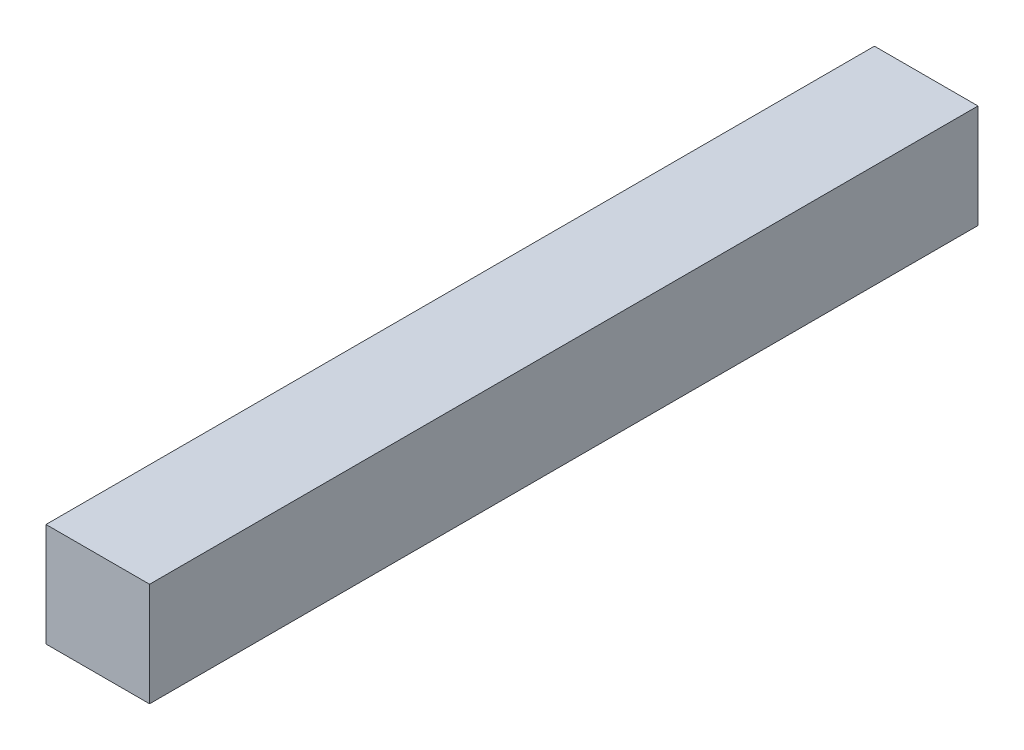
ISO-10303-21;
HEADER;
FILE_DESCRIPTION(('STEP AP214'),'2;1');
FILE_NAME('part.step','',(''),(''),'','','');
FILE_SCHEMA(('AUTOMOTIVE_DESIGN { 1 0 10303 214 1 1 1 1 }'));
ENDSEC;
DATA;
#1=APPLICATION_CONTEXT('core data for automotive mechanical design processes');
#2=APPLICATION_PROTOCOL_DEFINITION('international standard','automotive_design',2000,#1);
#3=PRODUCT_CONTEXT('',#1,'mechanical');
#4=PRODUCT('Part','Part','',(#3));
#5=PRODUCT_RELATED_PRODUCT_CATEGORY('part','',(#4));
#6=PRODUCT_DEFINITION_FORMATION('','',#4);
#7=PRODUCT_DEFINITION_CONTEXT('part definition',#1,'design');
#8=PRODUCT_DEFINITION('design','',#6,#7);
#9=PRODUCT_DEFINITION_SHAPE('','',#8);
#10=(LENGTH_UNIT() NAMED_UNIT(*) SI_UNIT(.MILLI.,.METRE.));
#11=(NAMED_UNIT(*) PLANE_ANGLE_UNIT() SI_UNIT($,.RADIAN.));
#12=(NAMED_UNIT(*) SI_UNIT($,.STERADIAN.) SOLID_ANGLE_UNIT());
#13=UNCERTAINTY_MEASURE_WITH_UNIT(LENGTH_MEASURE(1.E-05),#10,'distance_accuracy_value','');
#14=(GEOMETRIC_REPRESENTATION_CONTEXT(3) GLOBAL_UNCERTAINTY_ASSIGNED_CONTEXT((#13)) GLOBAL_UNIT_ASSIGNED_CONTEXT((#10,
#11,#12)) REPRESENTATION_CONTEXT('',''));
#15=CARTESIAN_POINT('',(0.,0.,0.));
#16=DIRECTION('',(0.,0.,1.));
#17=DIRECTION('',(1.,0.,0.));
#18=AXIS2_PLACEMENT_3D('',#15,#16,#17);
#19=CARTESIAN_POINT('',(0.,0.,200.));
#20=DIRECTION('',(1.,0.,0.));
#21=DIRECTION('',(0.,0.,-1.));
#22=AXIS2_PLACEMENT_3D('',#19,#20,#21);
#23=PLANE('',#22);
#24=DIRECTION('',(0.,-1.,0.));
#25=VECTOR('',#24,1.);
#26=CARTESIAN_POINT('',(0.,0.,0.));
#27=LINE('',#26,#25);
#28=CARTESIAN_POINT('',(0.,25.,0.));
#29=VERTEX_POINT('',#28);
#30=CARTESIAN_POINT('',(0.,0.,0.));
#31=VERTEX_POINT('',#30);
#32=EDGE_CURVE('E70',#29,#31,#27,.T.);
#33=ORIENTED_EDGE('',*,*,#32,.T.);
#34=DIRECTION('',(0.,0.,-1.));
#35=VECTOR('',#34,1.);
#36=CARTESIAN_POINT('',(0.,0.,200.));
#37=LINE('',#36,#35);
#38=CARTESIAN_POINT('',(0.,0.,200.));
#39=VERTEX_POINT('',#38);
#40=EDGE_CURVE('E11',#39,#31,#37,.T.);
#41=ORIENTED_EDGE('',*,*,#40,.F.);
#42=DIRECTION('',(0.,-1.,0.));
#43=VECTOR('',#42,1.);
#44=CARTESIAN_POINT('',(0.,0.,200.));
#45=LINE('',#44,#43);
#46=CARTESIAN_POINT('',(0.,25.,200.));
#47=VERTEX_POINT('',#46);
#48=EDGE_CURVE('E88',#47,#39,#45,.T.);
#49=ORIENTED_EDGE('',*,*,#48,.F.);
#50=DIRECTION('',(0.,0.,-1.));
#51=VECTOR('',#50,1.);
#52=CARTESIAN_POINT('',(0.,25.,200.));
#53=LINE('',#52,#51);
#54=EDGE_CURVE('E82',#47,#29,#53,.T.);
#55=ORIENTED_EDGE('',*,*,#54,.T.);
#56=EDGE_LOOP('',(#33,#41,#49,#55));
#57=FACE_BOUND('',#56,.T.);
#58=ADVANCED_FACE('F26',(#57),#23,.F.);
#59=CARTESIAN_POINT('',(0.,0.,200.));
#60=DIRECTION('',(0.,1.,0.));
#61=DIRECTION('',(0.,0.,1.));
#62=AXIS2_PLACEMENT_3D('',#59,#60,#61);
#63=PLANE('',#62);
#64=DIRECTION('',(1.,0.,0.));
#65=VECTOR('',#64,1.);
#66=CARTESIAN_POINT('',(0.,0.,0.));
#67=LINE('',#66,#65);
#68=CARTESIAN_POINT('',(25.,0.,0.));
#69=VERTEX_POINT('',#68);
#70=EDGE_CURVE('E66',#31,#69,#67,.T.);
#71=ORIENTED_EDGE('',*,*,#70,.T.);
#72=DIRECTION('',(0.,0.,-1.));
#73=VECTOR('',#72,1.);
#74=CARTESIAN_POINT('',(25.,0.,200.));
#75=LINE('',#74,#73);
#76=CARTESIAN_POINT('',(25.,0.,200.));
#77=VERTEX_POINT('',#76);
#78=EDGE_CURVE('E33',#77,#69,#75,.T.);
#79=ORIENTED_EDGE('',*,*,#78,.F.);
#80=DIRECTION('',(1.,0.,0.));
#81=VECTOR('',#80,1.);
#82=CARTESIAN_POINT('',(0.,0.,200.));
#83=LINE('',#82,#81);
#84=EDGE_CURVE('E78',#39,#77,#83,.T.);
#85=ORIENTED_EDGE('',*,*,#84,.F.);
#86=ORIENTED_EDGE('',*,*,#40,.T.);
#87=EDGE_LOOP('',(#71,#79,#85,#86));
#88=FACE_BOUND('',#87,.T.);
#89=ADVANCED_FACE('F77',(#88),#63,.F.);
#90=CARTESIAN_POINT('',(25.,0.,200.));
#91=DIRECTION('',(-1.,0.,0.));
#92=DIRECTION('',(0.,0.,1.));
#93=AXIS2_PLACEMENT_3D('',#90,#91,#92);
#94=PLANE('',#93);
#95=DIRECTION('',(0.,1.,0.));
#96=VECTOR('',#95,1.);
#97=CARTESIAN_POINT('',(25.,0.,0.));
#98=LINE('',#97,#96);
#99=CARTESIAN_POINT('',(25.,25.,0.));
#100=VERTEX_POINT('',#99);
#101=EDGE_CURVE('E71',#69,#100,#98,.T.);
#102=ORIENTED_EDGE('',*,*,#101,.T.);
#103=DIRECTION('',(0.,0.,-1.));
#104=VECTOR('',#103,1.);
#105=CARTESIAN_POINT('',(25.,25.,200.));
#106=LINE('',#105,#104);
#107=CARTESIAN_POINT('',(25.,25.,200.));
#108=VERTEX_POINT('',#107);
#109=EDGE_CURVE('E94',#108,#100,#106,.T.);
#110=ORIENTED_EDGE('',*,*,#109,.F.);
#111=DIRECTION('',(0.,1.,0.));
#112=VECTOR('',#111,1.);
#113=CARTESIAN_POINT('',(25.,0.,200.));
#114=LINE('',#113,#112);
#115=EDGE_CURVE('E45',#77,#108,#114,.T.);
#116=ORIENTED_EDGE('',*,*,#115,.F.);
#117=ORIENTED_EDGE('',*,*,#78,.T.);
#118=EDGE_LOOP('',(#102,#110,#116,#117));
#119=FACE_BOUND('',#118,.T.);
#120=ADVANCED_FACE('F97',(#119),#94,.F.);
#121=CARTESIAN_POINT('',(0.,25.,200.));
#122=DIRECTION('',(0.,-1.,0.));
#123=DIRECTION('',(0.,0.,-1.));
#124=AXIS2_PLACEMENT_3D('',#121,#122,#123);
#125=PLANE('',#124);
#126=DIRECTION('',(-1.,0.,0.));
#127=VECTOR('',#126,1.);
#128=CARTESIAN_POINT('',(0.,25.,0.));
#129=LINE('',#128,#127);
#130=EDGE_CURVE('E86',#100,#29,#129,.T.);
#131=ORIENTED_EDGE('',*,*,#130,.T.);
#132=ORIENTED_EDGE('',*,*,#54,.F.);
#133=DIRECTION('',(-1.,0.,0.));
#134=VECTOR('',#133,1.);
#135=CARTESIAN_POINT('',(0.,25.,200.));
#136=LINE('',#135,#134);
#137=EDGE_CURVE('E40',#108,#47,#136,.T.);
#138=ORIENTED_EDGE('',*,*,#137,.F.);
#139=ORIENTED_EDGE('',*,*,#109,.T.);
#140=EDGE_LOOP('',(#131,#132,#138,#139));
#141=FACE_BOUND('',#140,.T.);
#142=ADVANCED_FACE('F99',(#141),#125,.F.);
#143=CARTESIAN_POINT('',(0.,25.,200.));
#144=DIRECTION('',(0.,0.,-1.));
#145=DIRECTION('',(-1.,0.,0.));
#146=AXIS2_PLACEMENT_3D('',#143,#144,#145);
#147=PLANE('',#146);
#148=ORIENTED_EDGE('',*,*,#48,.T.);
#149=ORIENTED_EDGE('',*,*,#84,.T.);
#150=ORIENTED_EDGE('',*,*,#115,.T.);
#151=ORIENTED_EDGE('',*,*,#137,.T.);
#152=EDGE_LOOP('',(#148,#149,#150,#151));
#153=FACE_BOUND('',#152,.T.);
#154=ADVANCED_FACE('F100',(#153),#147,.F.);
#155=CARTESIAN_POINT('',(0.,25.,0.));
#156=DIRECTION('',(0.,0.,-1.));
#157=DIRECTION('',(-1.,0.,0.));
#158=AXIS2_PLACEMENT_3D('',#155,#156,#157);
#159=PLANE('',#158);
#160=ORIENTED_EDGE('',*,*,#32,.F.);
#161=ORIENTED_EDGE('',*,*,#130,.F.);
#162=ORIENTED_EDGE('',*,*,#101,.F.);
#163=ORIENTED_EDGE('',*,*,#70,.F.);
#164=EDGE_LOOP('',(#160,#161,#162,#163));
#165=FACE_BOUND('',#164,.T.);
#166=ADVANCED_FACE('F67',(#165),#159,.T.);
#167=CLOSED_SHELL('',(#58,#89,#120,#142,#154,#166));
#168=MANIFOLD_SOLID_BREP('B2',#167);
#169=ADVANCED_BREP_SHAPE_REPRESENTATION('',(#18,#168),#14);
#170=SHAPE_DEFINITION_REPRESENTATION(#9,#169);
ENDSEC;
END-ISO-10303-21;
